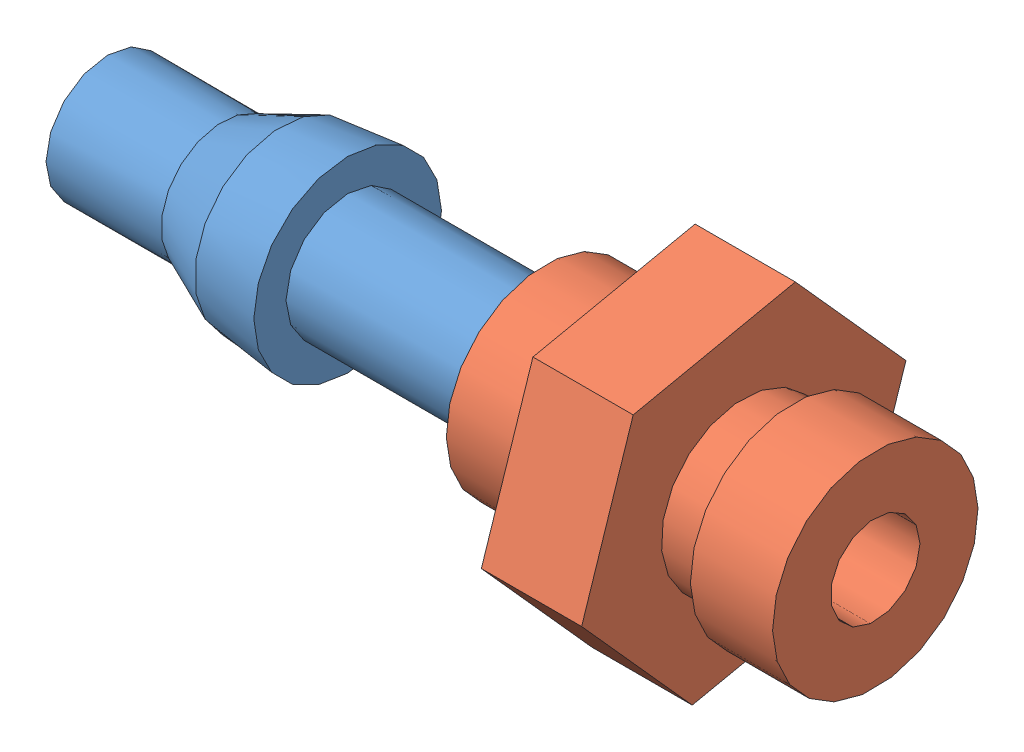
SolidWorks assembly GHF-8451-M PUMP INLET.SLDASM, configuration Default (file format 3400). Lengths in mm.
Overall size (29.65 16.93 16.8).
2 component instances, 2 part files, 2 mates.
Components (placement in the parent):
- GHF-8451-Mb PUMP INLET-1: GHF-8451-Mb PUMP INLET.SLDPRT [Default] at origin size (21.97 7.25 7.25)
- GHF-8451-Ma PUMP INLET-1: GHF-8451-Ma PUMP INLET.SLDPRT [Default] at (24.5745 0 0) x (0 -0.66741 0.744691) z (0 -0.744691 -0.66741) size (11.09 12.76 12.8)
Mates (geometry in assembly coordinates):
- Coincident1: coincident: plane of ?; plane of ?
- Concentric1: concentric aligned: cylinder of ?; cylinder of ?
